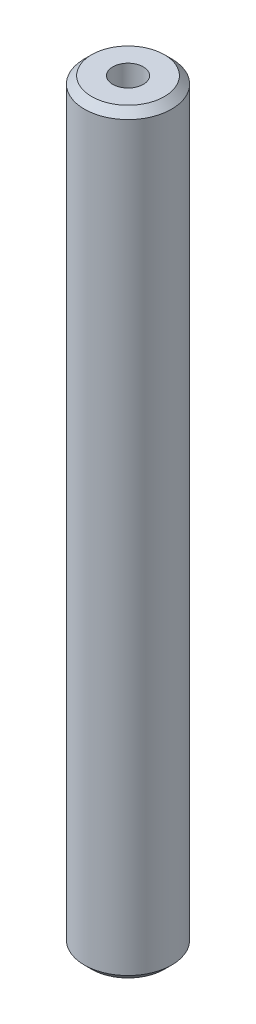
from build123d import *

# Parameters (mm, degrees)
SKETCH1_R                 = 6
EXTRUDE1_DEPTH            = 104
CHAMFER1_SIZE             = 1
M5X0_8_TAPPED_HOLE1_D     = 4.2
M5X0_8_TAPPED_HOLE1_DEPTH = 12.4
M5X0_8_TAPPED_HOLE1_TIP   = 1.2618073
M5X0_8_TAPPED_HOLE2_D     = 4.2
M5X0_8_TAPPED_HOLE2_DEPTH = 12.4
M5X0_8_TAPPED_HOLE2_TIP   = 1.2618073


with BuildPart() as part:
    # Sketch1 → Extrude1 (new body)
    with BuildSketch(Plane(origin=(0, 0, 0), x_dir=(1, 0, 0), z_dir=(0, 1, 0))):
        with Locations(Location((0, 0, 0), (0, 0, 90))):
            Circle(SKETCH1_R)
    extrude(amount=EXTRUDE1_DEPTH)

    # Chamfer1
    chamfer1_edges = [part.edges().sort_by_distance(p)[0] for p in [
        (0, 0, 6),
        (0, 104, 6),
    ]]
    chamfer(chamfer1_edges, length=CHAMFER1_SIZE)

    # M5x0.8 Tapped Hole1
    with Locations(Plane(origin=(0, 104, 0), x_dir=(-1, 0, 0), z_dir=(0, 1, 0))):
        with Locations((0, 0)):
            Hole(M5X0_8_TAPPED_HOLE1_D / 2, depth=M5X0_8_TAPPED_HOLE1_DEPTH)
            with Locations((0, 0, -(M5X0_8_TAPPED_HOLE1_DEPTH + M5X0_8_TAPPED_HOLE1_TIP / 2))):  # 118° drill point
                Cone(0, M5X0_8_TAPPED_HOLE1_D / 2, M5X0_8_TAPPED_HOLE1_TIP, mode=Mode.SUBTRACT)

    # M5x0.8 Tapped Hole2
    with Locations(Plane.XZ):
        with Locations((0, 0)):
            Hole(M5X0_8_TAPPED_HOLE2_D / 2, depth=M5X0_8_TAPPED_HOLE2_DEPTH)
            with Locations((0, 0, -(M5X0_8_TAPPED_HOLE2_DEPTH + M5X0_8_TAPPED_HOLE2_TIP / 2))):  # 118° drill point
                Cone(0, M5X0_8_TAPPED_HOLE2_D / 2, M5X0_8_TAPPED_HOLE2_TIP, mode=Mode.SUBTRACT)


solid = part.part
